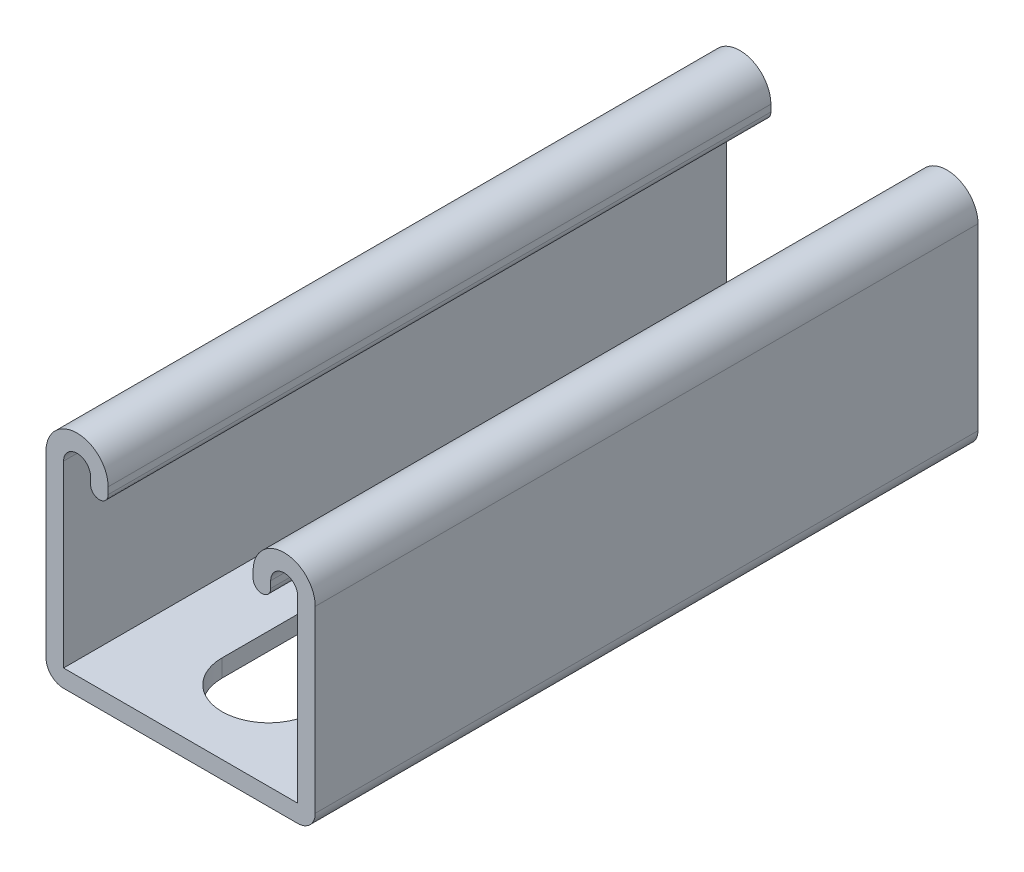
from build123d import *

# Parameters (mm, degrees)
BASE_EXTRUDE_DEPTH = 101.6
SLOT_DEPTH         = 133.120436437
LPATTERN1_COUNT    = 2
LPATTERN1_PITCH    = 50.8


with BuildPart() as part:
    # Sketch1 → Base-Extrude (new body)
    with BuildSketch(Plane.XY):
        with BuildLine():
            Line((-20.6375, 15.1511), (-20.6375, -12.319))
            ThreePointArc((-20.6375, -12.319), (-19.848914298, -14.222814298), (-17.9451, -15.0114))
            Line((-17.9451, -15.0114), (17.9451, -15.0114))
            ThreePointArc((17.9451, -15.0114), (19.848914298, -14.222814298), (20.6375, -12.319))
            Line((20.6375, -12.319), (20.6375, 15.1511))
            ThreePointArc((20.6375, 15.1511), (15.875, 19.9136), (11.1125, 15.1511))
            Line((11.1125, 15.1511), (11.1125, 14.11605))
            ThreePointArc((11.1125, 14.11605), (12.4587, 12.76985), (13.8049, 14.11605))
            Line((13.8049, 14.11605), (13.8049, 15.1511))
            ThreePointArc((13.8049, 15.1511), (15.875, 17.2212), (17.9451, 15.1511))
            Line((17.9451, 15.1511), (17.9451, -12.319))
            Line((17.9451, -12.319), (-17.9451, -12.319))
            Line((-17.9451, -12.319), (-17.9451, 15.1511))
            ThreePointArc((-17.9451, 15.1511), (-15.875, 17.2212), (-13.8049, 15.1511))
            Line((-13.8049, 15.1511), (-13.8049, 14.11605))
            ThreePointArc((-13.8049, 14.11605), (-12.4587, 12.76985), (-11.1125, 14.11605))
            Line((-11.1125, 14.11605), (-11.1125, 15.1511))
            ThreePointArc((-11.1125, 15.1511), (-15.875, 19.9136), (-20.6375, 15.1511))
        make_face()
    extrude(amount=BASE_EXTRUDE_DEPTH)

    # Sketch2 → Slot (cut, through all)
    with BuildSketch(Plane(origin=(0.747608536, -15.0114, -24.013419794), x_dir=(1, 0, 0), z_dir=(0, -1, 0))):
        with BuildLine():
            Line((6.396141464, 61.319669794), (6.396141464, 47.032169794))
            ThreePointArc((6.396141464, 47.032169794), (-0.747608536, 39.888419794), (-7.891358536, 47.032169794))
            Line((-7.891358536, 47.032169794), (-7.891358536, 61.319669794))
            ThreePointArc((-7.891358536, 61.319669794), (-0.747608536, 68.463419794), (6.396141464, 61.319669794))
        make_face()
    slot = extrude(amount=-SLOT_DEPTH, mode=Mode.SUBTRACT)

    # LPattern1: Slot ×2
    with Locations(*[(0, 0, i * LPATTERN1_PITCH) for i in range(1, LPATTERN1_COUNT)]):
        add(slot, mode=Mode.SUBTRACT)


solid = part.part
